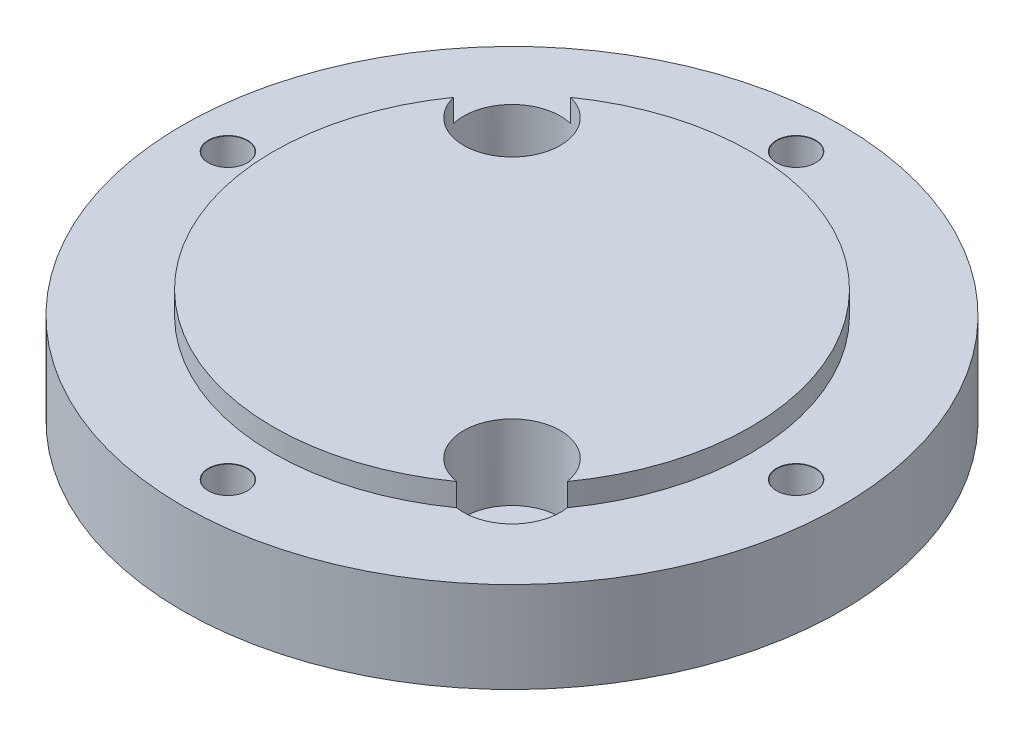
ISO-10303-21;
HEADER;
FILE_DESCRIPTION(('STEP AP214'),'2;1');
FILE_NAME('part.step','',(''),(''),'','','');
FILE_SCHEMA(('AUTOMOTIVE_DESIGN { 1 0 10303 214 1 1 1 1 }'));
ENDSEC;
DATA;
#1=APPLICATION_CONTEXT('core data for automotive mechanical design processes');
#2=APPLICATION_PROTOCOL_DEFINITION('international standard','automotive_design',2000,#1);
#3=PRODUCT_CONTEXT('',#1,'mechanical');
#4=PRODUCT('Part','Part','',(#3));
#5=PRODUCT_RELATED_PRODUCT_CATEGORY('part','',(#4));
#6=PRODUCT_DEFINITION_FORMATION('','',#4);
#7=PRODUCT_DEFINITION_CONTEXT('part definition',#1,'design');
#8=PRODUCT_DEFINITION('design','',#6,#7);
#9=PRODUCT_DEFINITION_SHAPE('','',#8);
#10=(LENGTH_UNIT() NAMED_UNIT(*) SI_UNIT(.MILLI.,.METRE.));
#11=(NAMED_UNIT(*) PLANE_ANGLE_UNIT() SI_UNIT($,.RADIAN.));
#12=(NAMED_UNIT(*) SI_UNIT($,.STERADIAN.) SOLID_ANGLE_UNIT());
#13=UNCERTAINTY_MEASURE_WITH_UNIT(LENGTH_MEASURE(1.E-05),#10,'distance_accuracy_value','');
#14=(GEOMETRIC_REPRESENTATION_CONTEXT(3) GLOBAL_UNCERTAINTY_ASSIGNED_CONTEXT((#13)) GLOBAL_UNIT_ASSIGNED_CONTEXT((#10,
#11,#12)) REPRESENTATION_CONTEXT('',''));
#15=CARTESIAN_POINT('',(0.,0.,0.));
#16=DIRECTION('',(0.,0.,1.));
#17=DIRECTION('',(1.,0.,0.));
#18=AXIS2_PLACEMENT_3D('',#15,#16,#17);
#19=CARTESIAN_POINT('',(0.,0.,0.));
#20=DIRECTION('',(0.,-1.,0.));
#21=DIRECTION('',(0.,0.,-1.));
#22=AXIS2_PLACEMENT_3D('',#19,#20,#21);
#23=PLANE('',#22);
#24=CARTESIAN_POINT('',(-13.0814754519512,0.,-13.0814754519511));
#25=DIRECTION('',(0.,1.,0.));
#26=DIRECTION('',(0.,0.,1.));
#27=AXIS2_PLACEMENT_3D('',#24,#25,#26);
#28=CIRCLE('',#27,2.275);
#29=CARTESIAN_POINT('',(-13.0814754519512,0.,-10.8064754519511));
#30=VERTEX_POINT('',#29);
#31=EDGE_CURVE('E78',#30,#30,#28,.T.);
#32=ORIENTED_EDGE('',*,*,#31,.T.);
#33=EDGE_LOOP('',(#32));
#34=FACE_BOUND('',#33,.T.);
#35=CARTESIAN_POINT('',(12.8834855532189,0.,12.8834855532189));
#36=DIRECTION('',(0.,1.,0.));
#37=DIRECTION('',(0.,0.,1.));
#38=AXIS2_PLACEMENT_3D('',#35,#36,#37);
#39=CIRCLE('',#38,2.275);
#40=CARTESIAN_POINT('',(12.8834855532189,0.,15.1584855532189));
#41=VERTEX_POINT('',#40);
#42=EDGE_CURVE('E186',#41,#41,#39,.T.);
#43=ORIENTED_EDGE('',*,*,#42,.T.);
#44=EDGE_LOOP('',(#43));
#45=FACE_BOUND('',#44,.T.);
#46=CARTESIAN_POINT('',(0.,0.,25.));
#47=DIRECTION('',(0.,-1.,0.));
#48=DIRECTION('',(0.,0.,-1.));
#49=AXIS2_PLACEMENT_3D('',#46,#47,#48);
#50=CIRCLE('',#49,3.025);
#51=CARTESIAN_POINT('',(0.,0.,21.975));
#52=VERTEX_POINT('',#51);
#53=EDGE_CURVE('E171',#52,#52,#50,.T.);
#54=ORIENTED_EDGE('',*,*,#53,.F.);
#55=EDGE_LOOP('',(#54));
#56=FACE_BOUND('',#55,.T.);
#57=CARTESIAN_POINT('',(0.,0.,-25.));
#58=DIRECTION('',(0.,-1.,0.));
#59=DIRECTION('',(0.,0.,-1.));
#60=AXIS2_PLACEMENT_3D('',#57,#58,#59);
#61=CIRCLE('',#60,3.025);
#62=CARTESIAN_POINT('',(0.,0.,-28.025));
#63=VERTEX_POINT('',#62);
#64=EDGE_CURVE('E150',#63,#63,#61,.T.);
#65=ORIENTED_EDGE('',*,*,#64,.F.);
#66=EDGE_LOOP('',(#65));
#67=FACE_BOUND('',#66,.T.);
#68=CARTESIAN_POINT('',(25.,0.,0.));
#69=DIRECTION('',(0.,-1.,0.));
#70=DIRECTION('',(0.,0.,-1.));
#71=AXIS2_PLACEMENT_3D('',#68,#69,#70);
#72=CIRCLE('',#71,3.025);
#73=CARTESIAN_POINT('',(25.,0.,-3.02499999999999));
#74=VERTEX_POINT('',#73);
#75=EDGE_CURVE('E129',#74,#74,#72,.T.);
#76=ORIENTED_EDGE('',*,*,#75,.F.);
#77=EDGE_LOOP('',(#76));
#78=FACE_BOUND('',#77,.T.);
#79=CARTESIAN_POINT('',(-25.,0.,0.));
#80=DIRECTION('',(0.,-1.,0.));
#81=DIRECTION('',(0.,0.,-1.));
#82=AXIS2_PLACEMENT_3D('',#79,#80,#81);
#83=CIRCLE('',#82,3.025);
#84=CARTESIAN_POINT('',(-25.,0.,-3.025));
#85=VERTEX_POINT('',#84);
#86=EDGE_CURVE('E108',#85,#85,#83,.T.);
#87=ORIENTED_EDGE('',*,*,#86,.F.);
#88=EDGE_LOOP('',(#87));
#89=FACE_BOUND('',#88,.T.);
#90=CARTESIAN_POINT('',(0.,0.,0.));
#91=DIRECTION('',(0.,-1.,0.));
#92=DIRECTION('',(0.,0.,-1.));
#93=AXIS2_PLACEMENT_3D('',#90,#91,#92);
#94=CIRCLE('',#93,29.);
#95=CARTESIAN_POINT('',(0.,0.,-29.));
#96=VERTEX_POINT('',#95);
#97=EDGE_CURVE('E86',#96,#96,#94,.T.);
#98=ORIENTED_EDGE('',*,*,#97,.T.);
#99=EDGE_LOOP('',(#98));
#100=FACE_BOUND('',#99,.T.);
#101=ADVANCED_FACE('F16',(#34,#45,#56,#67,#78,#89,#100),#23,.T.);
#102=CARTESIAN_POINT('',(0.,0.,0.));
#103=DIRECTION('',(0.,-1.,0.));
#104=DIRECTION('',(0.,0.,-1.));
#105=AXIS2_PLACEMENT_3D('',#102,#103,#104);
#106=CYLINDRICAL_SURFACE('',#105,29.);
#107=CARTESIAN_POINT('',(0.,8.,0.));
#108=DIRECTION('',(0.,-1.,0.));
#109=DIRECTION('',(0.,0.,-1.));
#110=AXIS2_PLACEMENT_3D('',#107,#108,#109);
#111=CIRCLE('',#110,29.);
#112=CARTESIAN_POINT('',(0.,8.,-29.));
#113=VERTEX_POINT('',#112);
#114=EDGE_CURVE('E90',#113,#113,#111,.T.);
#115=ORIENTED_EDGE('',*,*,#114,.T.);
#116=EDGE_LOOP('',(#115));
#117=FACE_BOUND('',#116,.T.);
#118=ORIENTED_EDGE('',*,*,#97,.F.);
#119=EDGE_LOOP('',(#118));
#120=FACE_BOUND('',#119,.T.);
#121=ADVANCED_FACE('F256',(#117,#120),#106,.T.);
#122=CARTESIAN_POINT('',(29.,8.,0.));
#123=DIRECTION('',(0.,1.,0.));
#124=DIRECTION('',(0.,0.,1.));
#125=AXIS2_PLACEMENT_3D('',#122,#123,#124);
#126=PLANE('',#125);
#127=CARTESIAN_POINT('',(12.8834855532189,8.,12.8834855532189));
#128=DIRECTION('',(0.,1.,0.));
#129=DIRECTION('',(0.,0.,1.));
#130=AXIS2_PLACEMENT_3D('',#127,#128,#129);
#131=CIRCLE('',#130,4.25);
#132=CARTESIAN_POINT('',(12.2165890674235,8.,17.0808357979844));
#133=VERTEX_POINT('',#132);
#134=CARTESIAN_POINT('',(17.0808357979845,8.,12.2165890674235));
#135=VERTEX_POINT('',#134);
#136=EDGE_CURVE('E73',#133,#135,#131,.T.);
#137=ORIENTED_EDGE('',*,*,#136,.F.);
#138=CARTESIAN_POINT('',(0.,8.,0.));
#139=DIRECTION('',(0.,1.,0.));
#140=DIRECTION('',(0.,0.,1.));
#141=AXIS2_PLACEMENT_3D('',#138,#139,#140);
#142=CIRCLE('',#141,21.);
#143=CARTESIAN_POINT('',(-17.2029180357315,8.,-12.0440695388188));
#144=VERTEX_POINT('',#143);
#145=EDGE_CURVE('E25',#144,#133,#142,.T.);
#146=ORIENTED_EDGE('',*,*,#145,.F.);
#147=CARTESIAN_POINT('',(-13.0814754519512,8.,-13.0814754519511));
#148=DIRECTION('',(0.,1.,0.));
#149=DIRECTION('',(0.,0.,1.));
#150=AXIS2_PLACEMENT_3D('',#147,#148,#149);
#151=CIRCLE('',#150,4.25);
#152=CARTESIAN_POINT('',(-12.0440695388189,8.,-17.2029180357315));
#153=VERTEX_POINT('',#152);
#154=EDGE_CURVE('E231',#153,#144,#151,.T.);
#155=ORIENTED_EDGE('',*,*,#154,.F.);
#156=CARTESIAN_POINT('',(0.,8.,0.));
#157=DIRECTION('',(0.,1.,0.));
#158=DIRECTION('',(0.,0.,1.));
#159=AXIS2_PLACEMENT_3D('',#156,#157,#158);
#160=CIRCLE('',#159,21.);
#161=EDGE_CURVE('E19',#135,#153,#160,.T.);
#162=ORIENTED_EDGE('',*,*,#161,.F.);
#163=EDGE_LOOP('',(#137,#146,#155,#162));
#164=FACE_BOUND('',#163,.T.);
#165=CARTESIAN_POINT('',(0.,8.,25.));
#166=DIRECTION('',(0.,-1.,0.));
#167=DIRECTION('',(0.,0.,-1.));
#168=AXIS2_PLACEMENT_3D('',#165,#166,#167);
#169=CIRCLE('',#168,1.725);
#170=CARTESIAN_POINT('',(0.,8.,23.275));
#171=VERTEX_POINT('',#170);
#172=EDGE_CURVE('E174',#171,#171,#169,.T.);
#173=ORIENTED_EDGE('',*,*,#172,.T.);
#174=EDGE_LOOP('',(#173));
#175=FACE_BOUND('',#174,.T.);
#176=CARTESIAN_POINT('',(0.,8.,-25.));
#177=DIRECTION('',(0.,-1.,0.));
#178=DIRECTION('',(0.,0.,-1.));
#179=AXIS2_PLACEMENT_3D('',#176,#177,#178);
#180=CIRCLE('',#179,1.725);
#181=CARTESIAN_POINT('',(0.,8.,-26.725));
#182=VERTEX_POINT('',#181);
#183=EDGE_CURVE('E153',#182,#182,#180,.T.);
#184=ORIENTED_EDGE('',*,*,#183,.T.);
#185=EDGE_LOOP('',(#184));
#186=FACE_BOUND('',#185,.T.);
#187=CARTESIAN_POINT('',(25.,8.,0.));
#188=DIRECTION('',(0.,-1.,0.));
#189=DIRECTION('',(0.,0.,-1.));
#190=AXIS2_PLACEMENT_3D('',#187,#188,#189);
#191=CIRCLE('',#190,1.725);
#192=CARTESIAN_POINT('',(25.,8.,-1.72499999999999));
#193=VERTEX_POINT('',#192);
#194=EDGE_CURVE('E132',#193,#193,#191,.T.);
#195=ORIENTED_EDGE('',*,*,#194,.T.);
#196=EDGE_LOOP('',(#195));
#197=FACE_BOUND('',#196,.T.);
#198=CARTESIAN_POINT('',(-25.,8.,0.));
#199=DIRECTION('',(0.,-1.,0.));
#200=DIRECTION('',(0.,0.,-1.));
#201=AXIS2_PLACEMENT_3D('',#198,#199,#200);
#202=CIRCLE('',#201,1.725);
#203=CARTESIAN_POINT('',(-25.,8.,-1.725));
#204=VERTEX_POINT('',#203);
#205=EDGE_CURVE('E111',#204,#204,#202,.T.);
#206=ORIENTED_EDGE('',*,*,#205,.T.);
#207=EDGE_LOOP('',(#206));
#208=FACE_BOUND('',#207,.T.);
#209=ORIENTED_EDGE('',*,*,#114,.F.);
#210=EDGE_LOOP('',(#209));
#211=FACE_BOUND('',#210,.T.);
#212=ADVANCED_FACE('F237',(#164,#175,#186,#197,#208,#211),#126,.T.);
#213=CARTESIAN_POINT('',(-25.,7.975,0.));
#214=DIRECTION('',(0.,1.,0.));
#215=DIRECTION('',(0.,0.,1.));
#216=AXIS2_PLACEMENT_3D('',#213,#214,#215);
#217=CONICAL_SURFACE('',#216,1.7,0.785398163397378);
#218=ORIENTED_EDGE('',*,*,#205,.F.);
#219=EDGE_LOOP('',(#218));
#220=FACE_BOUND('',#219,.T.);
#221=CARTESIAN_POINT('',(-25.,7.975,0.));
#222=DIRECTION('',(0.,-1.,0.));
#223=DIRECTION('',(0.,0.,-1.));
#224=AXIS2_PLACEMENT_3D('',#221,#222,#223);
#225=CIRCLE('',#224,1.7);
#226=CARTESIAN_POINT('',(-25.,7.975,-1.7));
#227=VERTEX_POINT('',#226);
#228=EDGE_CURVE('E93',#227,#227,#225,.T.);
#229=ORIENTED_EDGE('',*,*,#228,.T.);
#230=EDGE_LOOP('',(#229));
#231=FACE_BOUND('',#230,.T.);
#232=ADVANCED_FACE('F266',(#220,#231),#217,.F.);
#233=CARTESIAN_POINT('',(-25.,0.,0.));
#234=DIRECTION('',(0.,-1.,0.));
#235=DIRECTION('',(0.,0.,-1.));
#236=AXIS2_PLACEMENT_3D('',#233,#234,#235);
#237=CYLINDRICAL_SURFACE('',#236,1.7);
#238=ORIENTED_EDGE('',*,*,#228,.F.);
#239=EDGE_LOOP('',(#238));
#240=FACE_BOUND('',#239,.T.);
#241=CARTESIAN_POINT('',(-25.,3.425,0.));
#242=DIRECTION('',(0.,-1.,0.));
#243=DIRECTION('',(0.,0.,-1.));
#244=AXIS2_PLACEMENT_3D('',#241,#242,#243);
#245=CIRCLE('',#244,1.7);
#246=CARTESIAN_POINT('',(-25.,3.425,-1.7));
#247=VERTEX_POINT('',#246);
#248=EDGE_CURVE('E96',#247,#247,#245,.T.);
#249=ORIENTED_EDGE('',*,*,#248,.T.);
#250=EDGE_LOOP('',(#249));
#251=FACE_BOUND('',#250,.T.);
#252=ADVANCED_FACE('F272',(#240,#251),#237,.F.);
#253=CARTESIAN_POINT('',(-25.,3.4,0.));
#254=DIRECTION('',(0.,-1.,0.));
#255=DIRECTION('',(0.,0.,-1.));
#256=AXIS2_PLACEMENT_3D('',#253,#254,#255);
#257=CONICAL_SURFACE('',#256,1.725,0.785398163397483);
#258=ORIENTED_EDGE('',*,*,#248,.F.);
#259=EDGE_LOOP('',(#258));
#260=FACE_BOUND('',#259,.T.);
#261=CARTESIAN_POINT('',(-25.,3.4,0.));
#262=DIRECTION('',(0.,-1.,0.));
#263=DIRECTION('',(0.,0.,-1.));
#264=AXIS2_PLACEMENT_3D('',#261,#262,#263);
#265=CIRCLE('',#264,1.725);
#266=CARTESIAN_POINT('',(-25.,3.4,-1.725));
#267=VERTEX_POINT('',#266);
#268=EDGE_CURVE('E99',#267,#267,#265,.T.);
#269=ORIENTED_EDGE('',*,*,#268,.T.);
#270=EDGE_LOOP('',(#269));
#271=FACE_BOUND('',#270,.T.);
#272=ADVANCED_FACE('F276',(#260,#271),#257,.F.);
#273=CARTESIAN_POINT('',(-23.275,3.4,0.));
#274=DIRECTION('',(0.,1.,0.));
#275=DIRECTION('',(0.,0.,1.));
#276=AXIS2_PLACEMENT_3D('',#273,#274,#275);
#277=PLANE('',#276);
#278=ORIENTED_EDGE('',*,*,#268,.F.);
#279=EDGE_LOOP('',(#278));
#280=FACE_BOUND('',#279,.T.);
#281=CARTESIAN_POINT('',(-25.,3.4,0.));
#282=DIRECTION('',(0.,-1.,0.));
#283=DIRECTION('',(0.,0.,-1.));
#284=AXIS2_PLACEMENT_3D('',#281,#282,#283);
#285=CIRCLE('',#284,3.);
#286=CARTESIAN_POINT('',(-25.,3.4,-3.));
#287=VERTEX_POINT('',#286);
#288=EDGE_CURVE('E102',#287,#287,#285,.T.);
#289=ORIENTED_EDGE('',*,*,#288,.T.);
#290=EDGE_LOOP('',(#289));
#291=FACE_BOUND('',#290,.T.);
#292=ADVANCED_FACE('F280',(#280,#291),#277,.F.);
#293=CARTESIAN_POINT('',(-25.,0.,0.));
#294=DIRECTION('',(0.,-1.,0.));
#295=DIRECTION('',(0.,0.,-1.));
#296=AXIS2_PLACEMENT_3D('',#293,#294,#295);
#297=CYLINDRICAL_SURFACE('',#296,3.);
#298=ORIENTED_EDGE('',*,*,#288,.F.);
#299=EDGE_LOOP('',(#298));
#300=FACE_BOUND('',#299,.T.);
#301=CARTESIAN_POINT('',(-25.,0.025,0.));
#302=DIRECTION('',(0.,-1.,0.));
#303=DIRECTION('',(0.,0.,-1.));
#304=AXIS2_PLACEMENT_3D('',#301,#302,#303);
#305=CIRCLE('',#304,3.);
#306=CARTESIAN_POINT('',(-25.,0.025,-3.));
#307=VERTEX_POINT('',#306);
#308=EDGE_CURVE('E105',#307,#307,#305,.T.);
#309=ORIENTED_EDGE('',*,*,#308,.T.);
#310=EDGE_LOOP('',(#309));
#311=FACE_BOUND('',#310,.T.);
#312=ADVANCED_FACE('F284',(#300,#311),#297,.F.);
#313=CARTESIAN_POINT('',(-25.,0.,0.));
#314=DIRECTION('',(0.,-1.,0.));
#315=DIRECTION('',(0.,0.,-1.));
#316=AXIS2_PLACEMENT_3D('',#313,#314,#315);
#317=CONICAL_SURFACE('',#316,3.025,0.785398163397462);
#318=ORIENTED_EDGE('',*,*,#308,.F.);
#319=EDGE_LOOP('',(#318));
#320=FACE_BOUND('',#319,.T.);
#321=ORIENTED_EDGE('',*,*,#86,.T.);
#322=EDGE_LOOP('',(#321));
#323=FACE_BOUND('',#322,.T.);
#324=ADVANCED_FACE('F288',(#320,#323),#317,.F.);
#325=CARTESIAN_POINT('',(25.,7.975,0.));
#326=DIRECTION('',(0.,1.,0.));
#327=DIRECTION('',(0.,0.,1.));
#328=AXIS2_PLACEMENT_3D('',#325,#326,#327);
#329=CONICAL_SURFACE('',#328,1.7,0.785398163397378);
#330=ORIENTED_EDGE('',*,*,#194,.F.);
#331=EDGE_LOOP('',(#330));
#332=FACE_BOUND('',#331,.T.);
#333=CARTESIAN_POINT('',(25.,7.975,0.));
#334=DIRECTION('',(0.,-1.,0.));
#335=DIRECTION('',(0.,0.,-1.));
#336=AXIS2_PLACEMENT_3D('',#333,#334,#335);
#337=CIRCLE('',#336,1.7);
#338=CARTESIAN_POINT('',(25.,7.975,-1.69999999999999));
#339=VERTEX_POINT('',#338);
#340=EDGE_CURVE('E114',#339,#339,#337,.T.);
#341=ORIENTED_EDGE('',*,*,#340,.T.);
#342=EDGE_LOOP('',(#341));
#343=FACE_BOUND('',#342,.T.);
#344=ADVANCED_FACE('F292',(#332,#343),#329,.F.);
#345=CARTESIAN_POINT('',(25.,0.,0.));
#346=DIRECTION('',(0.,-1.,0.));
#347=DIRECTION('',(0.,0.,-1.));
#348=AXIS2_PLACEMENT_3D('',#345,#346,#347);
#349=CYLINDRICAL_SURFACE('',#348,1.7);
#350=ORIENTED_EDGE('',*,*,#340,.F.);
#351=EDGE_LOOP('',(#350));
#352=FACE_BOUND('',#351,.T.);
#353=CARTESIAN_POINT('',(25.,3.425,0.));
#354=DIRECTION('',(0.,-1.,0.));
#355=DIRECTION('',(0.,0.,-1.));
#356=AXIS2_PLACEMENT_3D('',#353,#354,#355);
#357=CIRCLE('',#356,1.7);
#358=CARTESIAN_POINT('',(25.,3.425,-1.69999999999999));
#359=VERTEX_POINT('',#358);
#360=EDGE_CURVE('E117',#359,#359,#357,.T.);
#361=ORIENTED_EDGE('',*,*,#360,.T.);
#362=EDGE_LOOP('',(#361));
#363=FACE_BOUND('',#362,.T.);
#364=ADVANCED_FACE('F296',(#352,#363),#349,.F.);
#365=CARTESIAN_POINT('',(25.,3.4,0.));
#366=DIRECTION('',(0.,-1.,0.));
#367=DIRECTION('',(0.,0.,-1.));
#368=AXIS2_PLACEMENT_3D('',#365,#366,#367);
#369=CONICAL_SURFACE('',#368,1.725,0.785398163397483);
#370=ORIENTED_EDGE('',*,*,#360,.F.);
#371=EDGE_LOOP('',(#370));
#372=FACE_BOUND('',#371,.T.);
#373=CARTESIAN_POINT('',(25.,3.4,0.));
#374=DIRECTION('',(0.,-1.,0.));
#375=DIRECTION('',(0.,0.,-1.));
#376=AXIS2_PLACEMENT_3D('',#373,#374,#375);
#377=CIRCLE('',#376,1.725);
#378=CARTESIAN_POINT('',(25.,3.4,-1.72499999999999));
#379=VERTEX_POINT('',#378);
#380=EDGE_CURVE('E120',#379,#379,#377,.T.);
#381=ORIENTED_EDGE('',*,*,#380,.T.);
#382=EDGE_LOOP('',(#381));
#383=FACE_BOUND('',#382,.T.);
#384=ADVANCED_FACE('F300',(#372,#383),#369,.F.);
#385=CARTESIAN_POINT('',(26.725,3.4,0.));
#386=DIRECTION('',(0.,1.,0.));
#387=DIRECTION('',(0.,0.,1.));
#388=AXIS2_PLACEMENT_3D('',#385,#386,#387);
#389=PLANE('',#388);
#390=ORIENTED_EDGE('',*,*,#380,.F.);
#391=EDGE_LOOP('',(#390));
#392=FACE_BOUND('',#391,.T.);
#393=CARTESIAN_POINT('',(25.,3.4,0.));
#394=DIRECTION('',(0.,-1.,0.));
#395=DIRECTION('',(0.,0.,-1.));
#396=AXIS2_PLACEMENT_3D('',#393,#394,#395);
#397=CIRCLE('',#396,3.);
#398=CARTESIAN_POINT('',(25.,3.4,-2.99999999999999));
#399=VERTEX_POINT('',#398);
#400=EDGE_CURVE('E123',#399,#399,#397,.T.);
#401=ORIENTED_EDGE('',*,*,#400,.T.);
#402=EDGE_LOOP('',(#401));
#403=FACE_BOUND('',#402,.T.);
#404=ADVANCED_FACE('F304',(#392,#403),#389,.F.);
#405=CARTESIAN_POINT('',(25.,0.,0.));
#406=DIRECTION('',(0.,-1.,0.));
#407=DIRECTION('',(0.,0.,-1.));
#408=AXIS2_PLACEMENT_3D('',#405,#406,#407);
#409=CYLINDRICAL_SURFACE('',#408,3.);
#410=ORIENTED_EDGE('',*,*,#400,.F.);
#411=EDGE_LOOP('',(#410));
#412=FACE_BOUND('',#411,.T.);
#413=CARTESIAN_POINT('',(25.,0.025,0.));
#414=DIRECTION('',(0.,-1.,0.));
#415=DIRECTION('',(0.,0.,-1.));
#416=AXIS2_PLACEMENT_3D('',#413,#414,#415);
#417=CIRCLE('',#416,3.);
#418=CARTESIAN_POINT('',(25.,0.025,-2.99999999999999));
#419=VERTEX_POINT('',#418);
#420=EDGE_CURVE('E126',#419,#419,#417,.T.);
#421=ORIENTED_EDGE('',*,*,#420,.T.);
#422=EDGE_LOOP('',(#421));
#423=FACE_BOUND('',#422,.T.);
#424=ADVANCED_FACE('F308',(#412,#423),#409,.F.);
#425=CARTESIAN_POINT('',(25.,0.,0.));
#426=DIRECTION('',(0.,-1.,0.));
#427=DIRECTION('',(0.,0.,-1.));
#428=AXIS2_PLACEMENT_3D('',#425,#426,#427);
#429=CONICAL_SURFACE('',#428,3.025,0.785398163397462);
#430=ORIENTED_EDGE('',*,*,#420,.F.);
#431=EDGE_LOOP('',(#430));
#432=FACE_BOUND('',#431,.T.);
#433=ORIENTED_EDGE('',*,*,#75,.T.);
#434=EDGE_LOOP('',(#433));
#435=FACE_BOUND('',#434,.T.);
#436=ADVANCED_FACE('F312',(#432,#435),#429,.F.);
#437=CARTESIAN_POINT('',(0.,7.975,-25.));
#438=DIRECTION('',(0.,1.,0.));
#439=DIRECTION('',(0.,0.,1.));
#440=AXIS2_PLACEMENT_3D('',#437,#438,#439);
#441=CONICAL_SURFACE('',#440,1.7,0.785398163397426);
#442=ORIENTED_EDGE('',*,*,#183,.F.);
#443=EDGE_LOOP('',(#442));
#444=FACE_BOUND('',#443,.T.);
#445=CARTESIAN_POINT('',(0.,7.975,-25.));
#446=DIRECTION('',(0.,-1.,0.));
#447=DIRECTION('',(0.,0.,-1.));
#448=AXIS2_PLACEMENT_3D('',#445,#446,#447);
#449=CIRCLE('',#448,1.7);
#450=CARTESIAN_POINT('',(0.,7.975,-26.7));
#451=VERTEX_POINT('',#450);
#452=EDGE_CURVE('E135',#451,#451,#449,.T.);
#453=ORIENTED_EDGE('',*,*,#452,.T.);
#454=EDGE_LOOP('',(#453));
#455=FACE_BOUND('',#454,.T.);
#456=ADVANCED_FACE('F316',(#444,#455),#441,.F.);
#457=CARTESIAN_POINT('',(0.,0.,-25.));
#458=DIRECTION('',(0.,-1.,0.));
#459=DIRECTION('',(0.,0.,-1.));
#460=AXIS2_PLACEMENT_3D('',#457,#458,#459);
#461=CYLINDRICAL_SURFACE('',#460,1.7);
#462=ORIENTED_EDGE('',*,*,#452,.F.);
#463=EDGE_LOOP('',(#462));
#464=FACE_BOUND('',#463,.T.);
#465=CARTESIAN_POINT('',(0.,3.425,-25.));
#466=DIRECTION('',(0.,-1.,0.));
#467=DIRECTION('',(0.,0.,-1.));
#468=AXIS2_PLACEMENT_3D('',#465,#466,#467);
#469=CIRCLE('',#468,1.7);
#470=CARTESIAN_POINT('',(0.,3.425,-26.7));
#471=VERTEX_POINT('',#470);
#472=EDGE_CURVE('E138',#471,#471,#469,.T.);
#473=ORIENTED_EDGE('',*,*,#472,.T.);
#474=EDGE_LOOP('',(#473));
#475=FACE_BOUND('',#474,.T.);
#476=ADVANCED_FACE('F320',(#464,#475),#461,.F.);
#477=CARTESIAN_POINT('',(0.,3.4,-25.));
#478=DIRECTION('',(0.,-1.,0.));
#479=DIRECTION('',(0.,0.,-1.));
#480=AXIS2_PLACEMENT_3D('',#477,#478,#479);
#481=CONICAL_SURFACE('',#480,1.725,0.785398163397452);
#482=ORIENTED_EDGE('',*,*,#472,.F.);
#483=EDGE_LOOP('',(#482));
#484=FACE_BOUND('',#483,.T.);
#485=CARTESIAN_POINT('',(0.,3.4,-25.));
#486=DIRECTION('',(0.,-1.,0.));
#487=DIRECTION('',(0.,0.,-1.));
#488=AXIS2_PLACEMENT_3D('',#485,#486,#487);
#489=CIRCLE('',#488,1.725);
#490=CARTESIAN_POINT('',(0.,3.4,-26.725));
#491=VERTEX_POINT('',#490);
#492=EDGE_CURVE('E141',#491,#491,#489,.T.);
#493=ORIENTED_EDGE('',*,*,#492,.T.);
#494=EDGE_LOOP('',(#493));
#495=FACE_BOUND('',#494,.T.);
#496=ADVANCED_FACE('F324',(#484,#495),#481,.F.);
#497=CARTESIAN_POINT('',(1.725,3.4,-25.));
#498=DIRECTION('',(0.,1.,0.));
#499=DIRECTION('',(0.,0.,1.));
#500=AXIS2_PLACEMENT_3D('',#497,#498,#499);
#501=PLANE('',#500);
#502=ORIENTED_EDGE('',*,*,#492,.F.);
#503=EDGE_LOOP('',(#502));
#504=FACE_BOUND('',#503,.T.);
#505=CARTESIAN_POINT('',(0.,3.4,-25.));
#506=DIRECTION('',(0.,-1.,0.));
#507=DIRECTION('',(0.,0.,-1.));
#508=AXIS2_PLACEMENT_3D('',#505,#506,#507);
#509=CIRCLE('',#508,3.);
#510=CARTESIAN_POINT('',(0.,3.4,-28.));
#511=VERTEX_POINT('',#510);
#512=EDGE_CURVE('E144',#511,#511,#509,.T.);
#513=ORIENTED_EDGE('',*,*,#512,.T.);
#514=EDGE_LOOP('',(#513));
#515=FACE_BOUND('',#514,.T.);
#516=ADVANCED_FACE('F328',(#504,#515),#501,.F.);
#517=CARTESIAN_POINT('',(0.,0.,-25.));
#518=DIRECTION('',(0.,-1.,0.));
#519=DIRECTION('',(0.,0.,-1.));
#520=AXIS2_PLACEMENT_3D('',#517,#518,#519);
#521=CYLINDRICAL_SURFACE('',#520,3.);
#522=ORIENTED_EDGE('',*,*,#512,.F.);
#523=EDGE_LOOP('',(#522));
#524=FACE_BOUND('',#523,.T.);
#525=CARTESIAN_POINT('',(0.,0.025,-25.));
#526=DIRECTION('',(0.,-1.,0.));
#527=DIRECTION('',(0.,0.,-1.));
#528=AXIS2_PLACEMENT_3D('',#525,#526,#527);
#529=CIRCLE('',#528,3.);
#530=CARTESIAN_POINT('',(0.,0.025,-28.));
#531=VERTEX_POINT('',#530);
#532=EDGE_CURVE('E147',#531,#531,#529,.T.);
#533=ORIENTED_EDGE('',*,*,#532,.T.);
#534=EDGE_LOOP('',(#533));
#535=FACE_BOUND('',#534,.T.);
#536=ADVANCED_FACE('F332',(#524,#535),#521,.F.);
#537=CARTESIAN_POINT('',(0.,0.,-25.));
#538=DIRECTION('',(0.,-1.,0.));
#539=DIRECTION('',(0.,0.,-1.));
#540=AXIS2_PLACEMENT_3D('',#537,#538,#539);
#541=CONICAL_SURFACE('',#540,3.025,0.785398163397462);
#542=ORIENTED_EDGE('',*,*,#532,.F.);
#543=EDGE_LOOP('',(#542));
#544=FACE_BOUND('',#543,.T.);
#545=ORIENTED_EDGE('',*,*,#64,.T.);
#546=EDGE_LOOP('',(#545));
#547=FACE_BOUND('',#546,.T.);
#548=ADVANCED_FACE('F336',(#544,#547),#541,.F.);
#549=CARTESIAN_POINT('',(0.,7.975,25.));
#550=DIRECTION('',(0.,1.,0.));
#551=DIRECTION('',(0.,0.,1.));
#552=AXIS2_PLACEMENT_3D('',#549,#550,#551);
#553=CONICAL_SURFACE('',#552,1.7,0.785398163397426);
#554=ORIENTED_EDGE('',*,*,#172,.F.);
#555=EDGE_LOOP('',(#554));
#556=FACE_BOUND('',#555,.T.);
#557=CARTESIAN_POINT('',(0.,7.975,25.));
#558=DIRECTION('',(0.,-1.,0.));
#559=DIRECTION('',(0.,0.,-1.));
#560=AXIS2_PLACEMENT_3D('',#557,#558,#559);
#561=CIRCLE('',#560,1.7);
#562=CARTESIAN_POINT('',(0.,7.975,23.3));
#563=VERTEX_POINT('',#562);
#564=EDGE_CURVE('E156',#563,#563,#561,.T.);
#565=ORIENTED_EDGE('',*,*,#564,.T.);
#566=EDGE_LOOP('',(#565));
#567=FACE_BOUND('',#566,.T.);
#568=ADVANCED_FACE('F340',(#556,#567),#553,.F.);
#569=CARTESIAN_POINT('',(0.,0.,25.));
#570=DIRECTION('',(0.,-1.,0.));
#571=DIRECTION('',(0.,0.,-1.));
#572=AXIS2_PLACEMENT_3D('',#569,#570,#571);
#573=CYLINDRICAL_SURFACE('',#572,1.7);
#574=ORIENTED_EDGE('',*,*,#564,.F.);
#575=EDGE_LOOP('',(#574));
#576=FACE_BOUND('',#575,.T.);
#577=CARTESIAN_POINT('',(0.,3.425,25.));
#578=DIRECTION('',(0.,-1.,0.));
#579=DIRECTION('',(0.,0.,-1.));
#580=AXIS2_PLACEMENT_3D('',#577,#578,#579);
#581=CIRCLE('',#580,1.7);
#582=CARTESIAN_POINT('',(0.,3.425,23.3));
#583=VERTEX_POINT('',#582);
#584=EDGE_CURVE('E159',#583,#583,#581,.T.);
#585=ORIENTED_EDGE('',*,*,#584,.T.);
#586=EDGE_LOOP('',(#585));
#587=FACE_BOUND('',#586,.T.);
#588=ADVANCED_FACE('F344',(#576,#587),#573,.F.);
#589=CARTESIAN_POINT('',(0.,3.4,25.));
#590=DIRECTION('',(0.,-1.,0.));
#591=DIRECTION('',(0.,0.,-1.));
#592=AXIS2_PLACEMENT_3D('',#589,#590,#591);
#593=CONICAL_SURFACE('',#592,1.725,0.785398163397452);
#594=ORIENTED_EDGE('',*,*,#584,.F.);
#595=EDGE_LOOP('',(#594));
#596=FACE_BOUND('',#595,.T.);
#597=CARTESIAN_POINT('',(0.,3.4,25.));
#598=DIRECTION('',(0.,-1.,0.));
#599=DIRECTION('',(0.,0.,-1.));
#600=AXIS2_PLACEMENT_3D('',#597,#598,#599);
#601=CIRCLE('',#600,1.725);
#602=CARTESIAN_POINT('',(0.,3.4,23.275));
#603=VERTEX_POINT('',#602);
#604=EDGE_CURVE('E162',#603,#603,#601,.T.);
#605=ORIENTED_EDGE('',*,*,#604,.T.);
#606=EDGE_LOOP('',(#605));
#607=FACE_BOUND('',#606,.T.);
#608=ADVANCED_FACE('F348',(#596,#607),#593,.F.);
#609=CARTESIAN_POINT('',(1.725,3.4,25.));
#610=DIRECTION('',(0.,1.,0.));
#611=DIRECTION('',(0.,0.,1.));
#612=AXIS2_PLACEMENT_3D('',#609,#610,#611);
#613=PLANE('',#612);
#614=ORIENTED_EDGE('',*,*,#604,.F.);
#615=EDGE_LOOP('',(#614));
#616=FACE_BOUND('',#615,.T.);
#617=CARTESIAN_POINT('',(0.,3.4,25.));
#618=DIRECTION('',(0.,-1.,0.));
#619=DIRECTION('',(0.,0.,-1.));
#620=AXIS2_PLACEMENT_3D('',#617,#618,#619);
#621=CIRCLE('',#620,3.);
#622=CARTESIAN_POINT('',(0.,3.4,22.));
#623=VERTEX_POINT('',#622);
#624=EDGE_CURVE('E165',#623,#623,#621,.T.);
#625=ORIENTED_EDGE('',*,*,#624,.T.);
#626=EDGE_LOOP('',(#625));
#627=FACE_BOUND('',#626,.T.);
#628=ADVANCED_FACE('F352',(#616,#627),#613,.F.);
#629=CARTESIAN_POINT('',(0.,0.,25.));
#630=DIRECTION('',(0.,-1.,0.));
#631=DIRECTION('',(0.,0.,-1.));
#632=AXIS2_PLACEMENT_3D('',#629,#630,#631);
#633=CYLINDRICAL_SURFACE('',#632,3.);
#634=ORIENTED_EDGE('',*,*,#624,.F.);
#635=EDGE_LOOP('',(#634));
#636=FACE_BOUND('',#635,.T.);
#637=CARTESIAN_POINT('',(0.,0.025,25.));
#638=DIRECTION('',(0.,-1.,0.));
#639=DIRECTION('',(0.,0.,-1.));
#640=AXIS2_PLACEMENT_3D('',#637,#638,#639);
#641=CIRCLE('',#640,3.);
#642=CARTESIAN_POINT('',(0.,0.025,22.));
#643=VERTEX_POINT('',#642);
#644=EDGE_CURVE('E168',#643,#643,#641,.T.);
#645=ORIENTED_EDGE('',*,*,#644,.T.);
#646=EDGE_LOOP('',(#645));
#647=FACE_BOUND('',#646,.T.);
#648=ADVANCED_FACE('F356',(#636,#647),#633,.F.);
#649=CARTESIAN_POINT('',(0.,0.,25.));
#650=DIRECTION('',(0.,-1.,0.));
#651=DIRECTION('',(0.,0.,-1.));
#652=AXIS2_PLACEMENT_3D('',#649,#650,#651);
#653=CONICAL_SURFACE('',#652,3.025,0.785398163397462);
#654=ORIENTED_EDGE('',*,*,#644,.F.);
#655=EDGE_LOOP('',(#654));
#656=FACE_BOUND('',#655,.T.);
#657=ORIENTED_EDGE('',*,*,#53,.T.);
#658=EDGE_LOOP('',(#657));
#659=FACE_BOUND('',#658,.T.);
#660=ADVANCED_FACE('F360',(#656,#659),#653,.F.);
#661=CARTESIAN_POINT('',(12.8834855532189,0.024999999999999,12.8834855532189));
#662=DIRECTION('',(0.,-1.,0.));
#663=DIRECTION('',(0.,0.,-1.));
#664=AXIS2_PLACEMENT_3D('',#661,#662,#663);
#665=CONICAL_SURFACE('',#664,2.25,0.785398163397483);
#666=ORIENTED_EDGE('',*,*,#42,.F.);
#667=EDGE_LOOP('',(#666));
#668=FACE_BOUND('',#667,.T.);
#669=CARTESIAN_POINT('',(12.8834855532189,0.024999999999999,12.8834855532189));
#670=DIRECTION('',(0.,1.,0.));
#671=DIRECTION('',(0.,0.,1.));
#672=AXIS2_PLACEMENT_3D('',#669,#670,#671);
#673=CIRCLE('',#672,2.25);
#674=CARTESIAN_POINT('',(12.8834855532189,0.024999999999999,15.1334855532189));
#675=VERTEX_POINT('',#674);
#676=EDGE_CURVE('E177',#675,#675,#673,.T.);
#677=ORIENTED_EDGE('',*,*,#676,.T.);
#678=EDGE_LOOP('',(#677));
#679=FACE_BOUND('',#678,.T.);
#680=ADVANCED_FACE('F364',(#668,#679),#665,.F.);
#681=CARTESIAN_POINT('',(12.8834855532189,8.,12.8834855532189));
#682=DIRECTION('',(0.,1.,0.));
#683=DIRECTION('',(0.,0.,1.));
#684=AXIS2_PLACEMENT_3D('',#681,#682,#683);
#685=CYLINDRICAL_SURFACE('',#684,2.25);
#686=ORIENTED_EDGE('',*,*,#676,.F.);
#687=EDGE_LOOP('',(#686));
#688=FACE_BOUND('',#687,.T.);
#689=CARTESIAN_POINT('',(12.8834855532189,3.375,12.8834855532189));
#690=DIRECTION('',(0.,1.,0.));
#691=DIRECTION('',(0.,0.,1.));
#692=AXIS2_PLACEMENT_3D('',#689,#690,#691);
#693=CIRCLE('',#692,2.25);
#694=CARTESIAN_POINT('',(12.8834855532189,3.375,15.1334855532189));
#695=VERTEX_POINT('',#694);
#696=EDGE_CURVE('E180',#695,#695,#693,.T.);
#697=ORIENTED_EDGE('',*,*,#696,.T.);
#698=EDGE_LOOP('',(#697));
#699=FACE_BOUND('',#698,.T.);
#700=ADVANCED_FACE('F368',(#688,#699),#685,.F.);
#701=CARTESIAN_POINT('',(12.8834855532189,3.4,12.8834855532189));
#702=DIRECTION('',(0.,1.,0.));
#703=DIRECTION('',(0.,0.,1.));
#704=AXIS2_PLACEMENT_3D('',#701,#702,#703);
#705=CONICAL_SURFACE('',#704,2.275,0.785398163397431);
#706=ORIENTED_EDGE('',*,*,#696,.F.);
#707=EDGE_LOOP('',(#706));
#708=FACE_BOUND('',#707,.T.);
#709=CARTESIAN_POINT('',(12.8834855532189,3.4,12.8834855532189));
#710=DIRECTION('',(0.,1.,0.));
#711=DIRECTION('',(0.,0.,1.));
#712=AXIS2_PLACEMENT_3D('',#709,#710,#711);
#713=CIRCLE('',#712,2.275);
#714=CARTESIAN_POINT('',(12.8834855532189,3.4,15.1584855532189));
#715=VERTEX_POINT('',#714);
#716=EDGE_CURVE('E183',#715,#715,#713,.T.);
#717=ORIENTED_EDGE('',*,*,#716,.T.);
#718=EDGE_LOOP('',(#717));
#719=FACE_BOUND('',#718,.T.);
#720=ADVANCED_FACE('F372',(#708,#719),#705,.F.);
#721=CARTESIAN_POINT('',(15.1584855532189,3.4,12.8834855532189));
#722=DIRECTION('',(0.,-1.,0.));
#723=DIRECTION('',(0.,0.,-1.));
#724=AXIS2_PLACEMENT_3D('',#721,#722,#723);
#725=PLANE('',#724);
#726=ORIENTED_EDGE('',*,*,#716,.F.);
#727=EDGE_LOOP('',(#726));
#728=FACE_BOUND('',#727,.T.);
#729=CARTESIAN_POINT('',(12.8834855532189,3.4,12.8834855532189));
#730=DIRECTION('',(0.,1.,0.));
#731=DIRECTION('',(0.,0.,1.));
#732=AXIS2_PLACEMENT_3D('',#729,#730,#731);
#733=CIRCLE('',#732,4.25);
#734=CARTESIAN_POINT('',(12.8834855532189,3.4,17.1334855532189));
#735=VERTEX_POINT('',#734);
#736=EDGE_CURVE('E64',#735,#735,#733,.T.);
#737=ORIENTED_EDGE('',*,*,#736,.T.);
#738=EDGE_LOOP('',(#737));
#739=FACE_BOUND('',#738,.T.);
#740=ADVANCED_FACE('F206',(#728,#739),#725,.F.);
#741=CARTESIAN_POINT('',(-13.0814754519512,0.024999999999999,-13.0814754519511));
#742=DIRECTION('',(0.,-1.,0.));
#743=DIRECTION('',(0.,0.,-1.));
#744=AXIS2_PLACEMENT_3D('',#741,#742,#743);
#745=CONICAL_SURFACE('',#744,2.25,0.785398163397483);
#746=ORIENTED_EDGE('',*,*,#31,.F.);
#747=EDGE_LOOP('',(#746));
#748=FACE_BOUND('',#747,.T.);
#749=CARTESIAN_POINT('',(-13.0814754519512,0.024999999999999,-13.0814754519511));
#750=DIRECTION('',(0.,1.,0.));
#751=DIRECTION('',(0.,0.,1.));
#752=AXIS2_PLACEMENT_3D('',#749,#750,#751);
#753=CIRCLE('',#752,2.25);
#754=CARTESIAN_POINT('',(-13.0814754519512,0.024999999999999,-10.8314754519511));
#755=VERTEX_POINT('',#754);
#756=EDGE_CURVE('E189',#755,#755,#753,.T.);
#757=ORIENTED_EDGE('',*,*,#756,.T.);
#758=EDGE_LOOP('',(#757));
#759=FACE_BOUND('',#758,.T.);
#760=ADVANCED_FACE('F202',(#748,#759),#745,.F.);
#761=CARTESIAN_POINT('',(-13.0814754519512,8.,-13.0814754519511));
#762=DIRECTION('',(0.,1.,0.));
#763=DIRECTION('',(0.,0.,1.));
#764=AXIS2_PLACEMENT_3D('',#761,#762,#763);
#765=CYLINDRICAL_SURFACE('',#764,2.25);
#766=ORIENTED_EDGE('',*,*,#756,.F.);
#767=EDGE_LOOP('',(#766));
#768=FACE_BOUND('',#767,.T.);
#769=CARTESIAN_POINT('',(-13.0814754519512,3.375,-13.0814754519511));
#770=DIRECTION('',(0.,1.,0.));
#771=DIRECTION('',(0.,0.,1.));
#772=AXIS2_PLACEMENT_3D('',#769,#770,#771);
#773=CIRCLE('',#772,2.25);
#774=CARTESIAN_POINT('',(-13.0814754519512,3.375,-10.8314754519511));
#775=VERTEX_POINT('',#774);
#776=EDGE_CURVE('E192',#775,#775,#773,.T.);
#777=ORIENTED_EDGE('',*,*,#776,.T.);
#778=EDGE_LOOP('',(#777));
#779=FACE_BOUND('',#778,.T.);
#780=ADVANCED_FACE('F205',(#768,#779),#765,.F.);
#781=CARTESIAN_POINT('',(-13.0814754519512,3.4,-13.0814754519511));
#782=DIRECTION('',(0.,1.,0.));
#783=DIRECTION('',(0.,0.,1.));
#784=AXIS2_PLACEMENT_3D('',#781,#782,#783);
#785=CONICAL_SURFACE('',#784,2.275,0.785398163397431);
#786=ORIENTED_EDGE('',*,*,#776,.F.);
#787=EDGE_LOOP('',(#786));
#788=FACE_BOUND('',#787,.T.);
#789=CARTESIAN_POINT('',(-13.0814754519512,3.4,-13.0814754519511));
#790=DIRECTION('',(0.,1.,0.));
#791=DIRECTION('',(0.,0.,1.));
#792=AXIS2_PLACEMENT_3D('',#789,#790,#791);
#793=CIRCLE('',#792,2.275);
#794=CARTESIAN_POINT('',(-13.0814754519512,3.4,-10.8064754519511));
#795=VERTEX_POINT('',#794);
#796=EDGE_CURVE('E195',#795,#795,#793,.T.);
#797=ORIENTED_EDGE('',*,*,#796,.T.);
#798=EDGE_LOOP('',(#797));
#799=FACE_BOUND('',#798,.T.);
#800=ADVANCED_FACE('F212',(#788,#799),#785,.F.);
#801=CARTESIAN_POINT('',(-10.8064754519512,3.4,-13.0814754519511));
#802=DIRECTION('',(0.,-1.,0.));
#803=DIRECTION('',(0.,0.,-1.));
#804=AXIS2_PLACEMENT_3D('',#801,#802,#803);
#805=PLANE('',#804);
#806=ORIENTED_EDGE('',*,*,#796,.F.);
#807=EDGE_LOOP('',(#806));
#808=FACE_BOUND('',#807,.T.);
#809=CARTESIAN_POINT('',(-13.0814754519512,3.4,-13.0814754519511));
#810=DIRECTION('',(0.,1.,0.));
#811=DIRECTION('',(0.,0.,1.));
#812=AXIS2_PLACEMENT_3D('',#809,#810,#811);
#813=CIRCLE('',#812,4.25);
#814=CARTESIAN_POINT('',(-13.0814754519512,3.4,-8.8314754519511));
#815=VERTEX_POINT('',#814);
#816=EDGE_CURVE('E72',#815,#815,#813,.T.);
#817=ORIENTED_EDGE('',*,*,#816,.T.);
#818=EDGE_LOOP('',(#817));
#819=FACE_BOUND('',#818,.T.);
#820=ADVANCED_FACE('F218',(#808,#819),#805,.F.);
#821=CARTESIAN_POINT('',(0.,10.,0.));
#822=DIRECTION('',(0.,-1.,0.));
#823=DIRECTION('',(0.,0.,-1.));
#824=AXIS2_PLACEMENT_3D('',#821,#822,#823);
#825=CYLINDRICAL_SURFACE('',#824,21.);
#826=ORIENTED_EDGE('',*,*,#145,.T.);
#827=DIRECTION('',(0.,1.,0.));
#828=VECTOR('',#827,1.);
#829=CARTESIAN_POINT('',(12.2165890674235,6.7,17.0808357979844));
#830=LINE('',#829,#828);
#831=CARTESIAN_POINT('',(12.2165890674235,10.,17.0808357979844));
#832=VERTEX_POINT('',#831);
#833=EDGE_CURVE('E59',#133,#832,#830,.T.);
#834=ORIENTED_EDGE('',*,*,#833,.T.);
#835=CARTESIAN_POINT('',(0.,10.,0.));
#836=DIRECTION('',(0.,1.,0.));
#837=DIRECTION('',(0.,0.,1.));
#838=AXIS2_PLACEMENT_3D('',#835,#836,#837);
#839=CIRCLE('',#838,21.);
#840=CARTESIAN_POINT('',(-17.2029180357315,10.,-12.0440695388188));
#841=VERTEX_POINT('',#840);
#842=EDGE_CURVE('E70',#841,#832,#839,.T.);
#843=ORIENTED_EDGE('',*,*,#842,.F.);
#844=DIRECTION('',(0.,1.,0.));
#845=VECTOR('',#844,1.);
#846=CARTESIAN_POINT('',(-17.2029180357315,6.7,-12.0440695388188));
#847=LINE('',#846,#845);
#848=EDGE_CURVE('E40',#841,#144,#847,.F.);
#849=ORIENTED_EDGE('',*,*,#848,.T.);
#850=EDGE_LOOP('',(#826,#834,#843,#849));
#851=FACE_BOUND('',#850,.T.);
#852=ADVANCED_FACE('F69',(#851),#825,.T.);
#853=CARTESIAN_POINT('',(0.,10.,0.));
#854=DIRECTION('',(0.,-1.,0.));
#855=DIRECTION('',(0.,0.,-1.));
#856=AXIS2_PLACEMENT_3D('',#853,#854,#855);
#857=CYLINDRICAL_SURFACE('',#856,21.);
#858=CARTESIAN_POINT('',(0.,10.,0.));
#859=DIRECTION('',(0.,1.,0.));
#860=DIRECTION('',(0.,0.,1.));
#861=AXIS2_PLACEMENT_3D('',#858,#859,#860);
#862=CIRCLE('',#861,21.);
#863=CARTESIAN_POINT('',(17.0808357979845,10.,12.2165890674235));
#864=VERTEX_POINT('',#863);
#865=CARTESIAN_POINT('',(-12.0440695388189,10.,-17.2029180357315));
#866=VERTEX_POINT('',#865);
#867=EDGE_CURVE('E76',#864,#866,#862,.T.);
#868=ORIENTED_EDGE('',*,*,#867,.F.);
#869=DIRECTION('',(0.,1.,0.));
#870=VECTOR('',#869,1.);
#871=CARTESIAN_POINT('',(17.0808357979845,6.7,12.2165890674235));
#872=LINE('',#871,#870);
#873=EDGE_CURVE('E33',#864,#135,#872,.F.);
#874=ORIENTED_EDGE('',*,*,#873,.T.);
#875=ORIENTED_EDGE('',*,*,#161,.T.);
#876=DIRECTION('',(0.,1.,0.));
#877=VECTOR('',#876,1.);
#878=CARTESIAN_POINT('',(-12.0440695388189,6.7,-17.2029180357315));
#879=LINE('',#878,#877);
#880=EDGE_CURVE('E228',#153,#866,#879,.T.);
#881=ORIENTED_EDGE('',*,*,#880,.T.);
#882=EDGE_LOOP('',(#868,#874,#875,#881));
#883=FACE_BOUND('',#882,.T.);
#884=ADVANCED_FACE('F382',(#883),#857,.T.);
#885=CARTESIAN_POINT('',(-6.54073772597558,10.,-6.54073772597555));
#886=DIRECTION('',(0.,1.,0.));
#887=DIRECTION('',(0.,0.,1.));
#888=AXIS2_PLACEMENT_3D('',#885,#886,#887);
#889=PLANE('',#888);
#890=CARTESIAN_POINT('',(12.8834855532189,10.,12.8834855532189));
#891=DIRECTION('',(0.,1.,0.));
#892=DIRECTION('',(0.,0.,1.));
#893=AXIS2_PLACEMENT_3D('',#890,#891,#892);
#894=CIRCLE('',#893,4.25);
#895=EDGE_CURVE('E56',#864,#832,#894,.T.);
#896=ORIENTED_EDGE('',*,*,#895,.F.);
#897=ORIENTED_EDGE('',*,*,#867,.T.);
#898=CARTESIAN_POINT('',(-13.0814754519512,10.,-13.0814754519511));
#899=DIRECTION('',(0.,1.,0.));
#900=DIRECTION('',(0.,0.,1.));
#901=AXIS2_PLACEMENT_3D('',#898,#899,#900);
#902=CIRCLE('',#901,4.25);
#903=EDGE_CURVE('E11',#841,#866,#902,.T.);
#904=ORIENTED_EDGE('',*,*,#903,.F.);
#905=ORIENTED_EDGE('',*,*,#842,.T.);
#906=EDGE_LOOP('',(#896,#897,#904,#905));
#907=FACE_BOUND('',#906,.T.);
#908=ADVANCED_FACE('F75',(#907),#889,.T.);
#909=CARTESIAN_POINT('',(-13.0814754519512,3.4,-13.0814754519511));
#910=DIRECTION('',(0.,1.,0.));
#911=DIRECTION('',(0.,0.,1.));
#912=AXIS2_PLACEMENT_3D('',#909,#910,#911);
#913=CYLINDRICAL_SURFACE('',#912,4.25);
#914=ORIENTED_EDGE('',*,*,#816,.F.);
#915=EDGE_LOOP('',(#914));
#916=FACE_BOUND('',#915,.T.);
#917=ORIENTED_EDGE('',*,*,#903,.T.);
#918=ORIENTED_EDGE('',*,*,#880,.F.);
#919=ORIENTED_EDGE('',*,*,#154,.T.);
#920=ORIENTED_EDGE('',*,*,#848,.F.);
#921=EDGE_LOOP('',(#917,#918,#919,#920));
#922=FACE_BOUND('',#921,.T.);
#923=ADVANCED_FACE('F247',(#916,#922),#913,.F.);
#924=CARTESIAN_POINT('',(12.8834855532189,3.4,12.8834855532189));
#925=DIRECTION('',(0.,1.,0.));
#926=DIRECTION('',(0.,0.,1.));
#927=AXIS2_PLACEMENT_3D('',#924,#925,#926);
#928=CYLINDRICAL_SURFACE('',#927,4.25);
#929=ORIENTED_EDGE('',*,*,#736,.F.);
#930=EDGE_LOOP('',(#929));
#931=FACE_BOUND('',#930,.T.);
#932=ORIENTED_EDGE('',*,*,#136,.T.);
#933=ORIENTED_EDGE('',*,*,#873,.F.);
#934=ORIENTED_EDGE('',*,*,#895,.T.);
#935=ORIENTED_EDGE('',*,*,#833,.F.);
#936=EDGE_LOOP('',(#932,#933,#934,#935));
#937=FACE_BOUND('',#936,.T.);
#938=ADVANCED_FACE('F58',(#931,#937),#928,.F.);
#939=CLOSED_SHELL('',(#101,#121,#212,#232,#252,#272,#292,#312,#324,#344,#364,#384,#404,#424,
#436,#456,#476,#496,#516,#536,#548,#568,#588,#608,#628,#648,#660,#680,#700,#720,#740,#760,#780,
#800,#820,#852,#884,#908,#923,#938));
#940=MANIFOLD_SOLID_BREP('B1',#939);
#941=ADVANCED_BREP_SHAPE_REPRESENTATION('',(#18,#940),#14);
#942=SHAPE_DEFINITION_REPRESENTATION(#9,#941);
ENDSEC;
END-ISO-10303-21;
